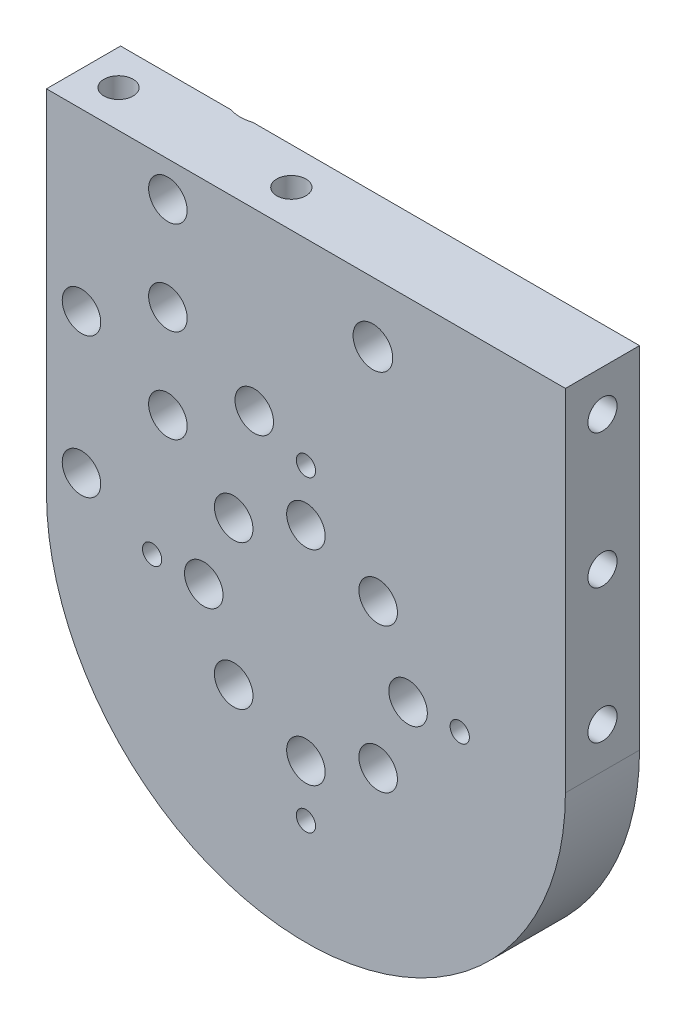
from build123d import *

# Parameters (mm, degrees)
BOSS_EXTRUDE1_DEPTH                                 = 12.7
F_4_CLEARANCE_HOLE1_D                               = 3.3
F_1_4_CLEARANCE_HOLE1_D                             = 6.6
F_1_4_CLEARANCE_HOLE2_D                             = 6.8
CSK_FOR_1_4_FLAT_HEAD_MACHINE_SCREW_100_D           = 6.6
CSK_FOR_1_4_FLAT_HEAD_MACHINE_SCREW_100_CSINK_D     = 12.6
CSK_FOR_1_4_FLAT_HEAD_MACHINE_SCREW_100_CSINK_ANGLE = 90
F_10_CLEARANCE_HOLE1_D                              = 5
F_10_CLEARANCE_HOLE1_DEPTH                          = 15
F_10_CLEARANCE_HOLE2_D                              = 5
F_10_CLEARANCE_HOLE2_DEPTH                          = 10
F_1_3_4_CLEARANCE_HOLE1_D                           = 45
F_1_3_4_CLEARANCE_HOLE1_DEPTH                       = 5
F_1_4_CLEARANCE_HOLE3_D                             = 6.6
F_1_4_CLEARANCE_HOLE3_DEPTH                         = 12.7
CHAMFER1_SIZE                                       = 3


with BuildPart() as part:
    # Sketch1 → Boss-Extrude1 (new body)
    with BuildSketch(Plane(origin=(0, 0, 0), x_dir=(-1, 0, 0), z_dir=(0, 0, -1))):
        with BuildLine():
            Line((44.45, 0), (44.45, 60))
            Line((44.45, 60), (-44.45, 60))
            Line((-44.45, 60), (-44.45, 0))
            ThreePointArc((-44.45, 0), (0, -44.45), (44.45, 0))
        make_face()
    extrude(amount=-BOSS_EXTRUDE1_DEPTH)

    # 4 Clearance Hole1 (through all)
    with Locations(Plane.XY.offset(12.7)):
        with Locations((26.35, 0), (0, -26.35), (-26.35, 0), (0, 26.35)):
            Hole(F_4_CLEARANCE_HOLE1_D / 2)

    # 1_4 Clearance Hole1 (through all)
    with Locations(Plane(origin=(0, 0, 0), x_dir=(-1, 0, 0), z_dir=(0, 0, -1))):
        with Locations((8.85, 30), (23.65, 38), (23.65, 22)):
            Hole(F_1_4_CLEARANCE_HOLE1_D / 2)

    # 1_4 Clearance Hole2 (through all)
    with Locations(Plane.XY.offset(12.7)):
        with Locations((11.472503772, 49.692873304)):
            Hole(F_1_4_CLEARANCE_HOLE2_D / 2)

    # CSK for 1_4 Flat Head Machine Screw _100 (through all)
    with Locations(Plane(origin=(0, 0, 0), x_dir=(-1, 0, 0), z_dir=(0, 0, -1))):
        with Locations((23.65, 54), (38.45, 6), (38.45, 30)):
            CounterSinkHole(CSK_FOR_1_4_FLAT_HEAD_MACHINE_SCREW_100_D / 2, CSK_FOR_1_4_FLAT_HEAD_MACHINE_SCREW_100_CSINK_D / 2, counter_sink_angle=CSK_FOR_1_4_FLAT_HEAD_MACHINE_SCREW_100_CSINK_ANGLE)

    # 10 Clearance Hole1
    with Locations(Plane(origin=(0, 60, 0), x_dir=(1, 0, 0), z_dir=(0, 1, 0))):
        with Locations((-38.45, -6.35), (-8.85, -6.35)):
            Hole(F_10_CLEARANCE_HOLE1_D / 2, depth=F_10_CLEARANCE_HOLE1_DEPTH)

    # 10 Clearance Hole2
    with Locations(Plane(origin=(44.45, 0, 0), x_dir=(0, 0, -1), z_dir=(1, 0, 0))):
        with Locations((-6.35, 7), (-6.35, 53), (-6.35, 30)):
            Hole(F_10_CLEARANCE_HOLE2_D / 2, depth=F_10_CLEARANCE_HOLE2_DEPTH)

    # 1-3_4 Clearance Hole1
    with Locations(Plane(origin=(0, 0, 0), x_dir=(-1, 0, 0), z_dir=(0, 0, -1))):
        with Locations((0, 0)):
            Hole(F_1_3_4_CLEARANCE_HOLE1_D / 2, depth=F_1_3_4_CLEARANCE_HOLE1_DEPTH)

    # 1_4 Clearance Hole3
    with Locations(Plane.XY.offset(12.7)):
        with Locations((12.374075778, 12.373661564), (17.499, -0.001), (12.372661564, -12.375075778), (-0.002, -17.5), (-12.376075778, -12.373661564), (-17.501, 0.001), (-12.374661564, 12.375075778), (0, 17.5)):
            Hole(F_1_4_CLEARANCE_HOLE3_D / 2, depth=F_1_4_CLEARANCE_HOLE3_DEPTH)

    # Chamfer1
    chamfer1_edges = [part.edges().sort_by_distance(p)[0] for p in [
        (-26.95, 22, 0),
        (-26.95, 38, 0),
        (-12.15, 30, 0),
    ]]
    chamfer(chamfer1_edges, length=CHAMFER1_SIZE)


solid = part.part
